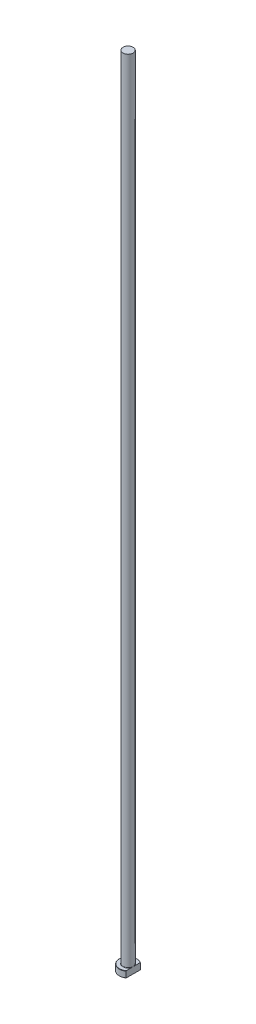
ISO-10303-21;
HEADER;
FILE_DESCRIPTION(('STEP AP214'),'2;1');
FILE_NAME('part.step','',(''),(''),'','','');
FILE_SCHEMA(('AUTOMOTIVE_DESIGN { 1 0 10303 214 1 1 1 1 }'));
ENDSEC;
DATA;
#1=APPLICATION_CONTEXT('core data for automotive mechanical design processes');
#2=APPLICATION_PROTOCOL_DEFINITION('international standard','automotive_design',2000,#1);
#3=PRODUCT_CONTEXT('',#1,'mechanical');
#4=PRODUCT('Part','Part','',(#3));
#5=PRODUCT_RELATED_PRODUCT_CATEGORY('part','',(#4));
#6=PRODUCT_DEFINITION_FORMATION('','',#4);
#7=PRODUCT_DEFINITION_CONTEXT('part definition',#1,'design');
#8=PRODUCT_DEFINITION('design','',#6,#7);
#9=PRODUCT_DEFINITION_SHAPE('','',#8);
#10=(LENGTH_UNIT() NAMED_UNIT(*) SI_UNIT(.MILLI.,.METRE.));
#11=(NAMED_UNIT(*) PLANE_ANGLE_UNIT() SI_UNIT($,.RADIAN.));
#12=(NAMED_UNIT(*) SI_UNIT($,.STERADIAN.) SOLID_ANGLE_UNIT());
#13=UNCERTAINTY_MEASURE_WITH_UNIT(LENGTH_MEASURE(1.E-05),#10,'distance_accuracy_value','');
#14=(GEOMETRIC_REPRESENTATION_CONTEXT(3) GLOBAL_UNCERTAINTY_ASSIGNED_CONTEXT((#13)) GLOBAL_UNIT_ASSIGNED_CONTEXT((#10,
#11,#12)) REPRESENTATION_CONTEXT('',''));
#15=CARTESIAN_POINT('',(0.,0.,0.));
#16=DIRECTION('',(0.,0.,1.));
#17=DIRECTION('',(1.,0.,0.));
#18=AXIS2_PLACEMENT_3D('',#15,#16,#17);
#19=CARTESIAN_POINT('',(0.,0.,0.));
#20=DIRECTION('',(0.,-1.,0.));
#21=DIRECTION('',(0.,0.,-1.));
#22=AXIS2_PLACEMENT_3D('',#19,#20,#21);
#23=PLANE('',#22);
#24=CARTESIAN_POINT('',(0.,0.,0.));
#25=DIRECTION('',(0.,-1.,0.));
#26=DIRECTION('',(0.,0.,-1.));
#27=AXIS2_PLACEMENT_3D('',#24,#25,#26);
#28=CIRCLE('',#27,6.80000000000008);
#29=CARTESIAN_POINT('',(3.99999999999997,0.,5.49909083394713));
#30=VERTEX_POINT('',#29);
#31=CARTESIAN_POINT('',(3.99999999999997,0.,-5.49909083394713));
#32=VERTEX_POINT('',#31);
#33=EDGE_CURVE('E98',#30,#32,#28,.T.);
#34=ORIENTED_EDGE('',*,*,#33,.T.);
#35=DIRECTION('',(0.,0.,1.));
#36=VECTOR('',#35,1.);
#37=CARTESIAN_POINT('',(3.99999999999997,0.,-5.74456264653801));
#38=LINE('',#37,#36);
#39=EDGE_CURVE('E83',#32,#30,#38,.T.);
#40=ORIENTED_EDGE('',*,*,#39,.T.);
#41=EDGE_LOOP('',(#34,#40));
#42=FACE_BOUND('',#41,.T.);
#43=ADVANCED_FACE('F32',(#42),#23,.T.);
#44=CARTESIAN_POINT('',(0.,259.958771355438,0.));
#45=DIRECTION('',(0.,1.,0.));
#46=DIRECTION('',(0.,0.,1.));
#47=AXIS2_PLACEMENT_3D('',#44,#45,#46);
#48=CYLINDRICAL_SURFACE('',#47,6.99999999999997);
#49=CARTESIAN_POINT('',(0.,4.79999999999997,0.));
#50=DIRECTION('',(0.,1.,0.));
#51=DIRECTION('',(0.,0.,1.));
#52=AXIS2_PLACEMENT_3D('',#49,#50,#51);
#53=CIRCLE('',#52,6.99999999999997);
#54=CARTESIAN_POINT('',(3.99999999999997,4.79999999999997,5.74456264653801));
#55=VERTEX_POINT('',#54);
#56=CARTESIAN_POINT('',(3.99999999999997,4.79999999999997,-5.74456264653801));
#57=VERTEX_POINT('',#56);
#58=EDGE_CURVE('E104',#55,#57,#53,.F.);
#59=ORIENTED_EDGE('',*,*,#58,.T.);
#60=DIRECTION('',(0.,-1.,0.));
#61=VECTOR('',#60,1.);
#62=CARTESIAN_POINT('',(3.99999999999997,630.,-5.74456264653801));
#63=LINE('',#62,#61);
#64=CARTESIAN_POINT('',(3.99999999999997,0.199999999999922,-5.74456264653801));
#65=VERTEX_POINT('',#64);
#66=EDGE_CURVE('E183',#57,#65,#63,.T.);
#67=ORIENTED_EDGE('',*,*,#66,.T.);
#68=CARTESIAN_POINT('',(0.,0.199999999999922,0.));
#69=DIRECTION('',(0.,-1.,0.));
#70=DIRECTION('',(0.,0.,-1.));
#71=AXIS2_PLACEMENT_3D('',#68,#69,#70);
#72=CIRCLE('',#71,6.99999999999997);
#73=CARTESIAN_POINT('',(3.99999999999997,0.199999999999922,5.74456264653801));
#74=VERTEX_POINT('',#73);
#75=EDGE_CURVE('E100',#65,#74,#72,.F.);
#76=ORIENTED_EDGE('',*,*,#75,.T.);
#77=DIRECTION('',(0.,-1.,0.));
#78=VECTOR('',#77,1.);
#79=CARTESIAN_POINT('',(3.99999999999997,630.,5.74456264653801));
#80=LINE('',#79,#78);
#81=EDGE_CURVE('E93',#55,#74,#80,.T.);
#82=ORIENTED_EDGE('',*,*,#81,.F.);
#83=EDGE_LOOP('',(#59,#67,#76,#82));
#84=FACE_BOUND('',#83,.T.);
#85=ADVANCED_FACE('F158',(#84),#48,.T.);
#86=CARTESIAN_POINT('',(-6.99999999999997,5.,0.));
#87=DIRECTION('',(0.,1.,0.));
#88=DIRECTION('',(0.,0.,1.));
#89=AXIS2_PLACEMENT_3D('',#86,#87,#88);
#90=PLANE('',#89);
#91=CARTESIAN_POINT('',(0.,5.,0.));
#92=DIRECTION('',(0.,1.,0.));
#93=DIRECTION('',(0.,0.,1.));
#94=AXIS2_PLACEMENT_3D('',#91,#92,#93);
#95=CIRCLE('',#94,6.79999999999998);
#96=CARTESIAN_POINT('',(3.99999999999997,5.,-5.499090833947));
#97=VERTEX_POINT('',#96);
#98=CARTESIAN_POINT('',(3.99999999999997,5.,5.499090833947));
#99=VERTEX_POINT('',#98);
#100=EDGE_CURVE('E178',#97,#99,#95,.T.);
#101=ORIENTED_EDGE('',*,*,#100,.T.);
#102=DIRECTION('',(0.,0.,-1.));
#103=VECTOR('',#102,1.);
#104=CARTESIAN_POINT('',(3.99999999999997,5.,0.));
#105=LINE('',#104,#103);
#106=CARTESIAN_POINT('',(3.99999999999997,4.99999999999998,1.28062484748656));
#107=VERTEX_POINT('',#106);
#108=EDGE_CURVE('E57',#99,#107,#105,.T.);
#109=ORIENTED_EDGE('',*,*,#108,.T.);
#110=CARTESIAN_POINT('',(0.,5.,0.));
#111=DIRECTION('',(0.,1.,0.));
#112=DIRECTION('',(0.,0.,1.));
#113=AXIS2_PLACEMENT_3D('',#110,#111,#112);
#114=CIRCLE('',#113,4.19999999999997);
#115=CARTESIAN_POINT('',(3.99999999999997,4.99999999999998,-1.28062484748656));
#116=VERTEX_POINT('',#115);
#117=EDGE_CURVE('E107',#107,#116,#114,.F.);
#118=ORIENTED_EDGE('',*,*,#117,.T.);
#119=EDGE_CURVE('E136',#116,#97,#105,.T.);
#120=ORIENTED_EDGE('',*,*,#119,.T.);
#121=EDGE_LOOP('',(#101,#109,#118,#120));
#122=FACE_BOUND('',#121,.T.);
#123=ADVANCED_FACE('F147',(#122),#90,.T.);
#124=CARTESIAN_POINT('',(0.,5.,0.));
#125=DIRECTION('',(0.,-1.,0.));
#126=DIRECTION('',(0.,0.,-1.));
#127=AXIS2_PLACEMENT_3D('',#124,#125,#126);
#128=CONICAL_SURFACE('',#127,6.79999999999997,0.785398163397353);
#129=ORIENTED_EDGE('',*,*,#58,.F.);
#130=CARTESIAN_POINT('',(3.99999999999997,-1.45712845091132,12.6392822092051));
#131=CARTESIAN_POINT('',(3.99999999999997,-1.24364466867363,12.4153556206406));
#132=CARTESIAN_POINT('',(3.99999999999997,-1.03042430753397,12.1911774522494));
#133=CARTESIAN_POINT('',(3.99999999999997,-0.604617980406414,11.7422167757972));
#134=CARTESIAN_POINT('',(3.99999999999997,-0.392032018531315,11.5174342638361));
#135=CARTESIAN_POINT('',(3.99999999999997,0.0324624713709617,11.0670952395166));
#136=CARTESIAN_POINT('',(3.99999999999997,0.244370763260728,10.8415385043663));
#137=CARTESIAN_POINT('',(3.99999999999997,0.667290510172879,10.3895875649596));
#138=CARTESIAN_POINT('',(3.99999999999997,0.878301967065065,10.1631933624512));
#139=CARTESIAN_POINT('',(3.99999999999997,1.51385375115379,9.4781012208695));
#140=CARTESIAN_POINT('',(3.99999999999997,1.93676291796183,9.01788214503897));
#141=CARTESIAN_POINT('',(3.99999999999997,2.56612335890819,8.32309905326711));
#142=CARTESIAN_POINT('',(3.99999999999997,2.77505666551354,8.09078457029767));
#143=CARTESIAN_POINT('',(3.99999999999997,3.19080254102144,7.62426940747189));
#144=CARTESIAN_POINT('',(3.99999999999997,3.3976151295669,7.39006874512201));
#145=CARTESIAN_POINT('',(3.99999999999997,3.87870763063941,6.83891844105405));
#146=CARTESIAN_POINT('',(3.99999999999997,4.15190978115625,6.52102188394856));
#147=CARTESIAN_POINT('',(3.99999999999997,4.55642425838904,6.0396090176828));
#148=CARTESIAN_POINT('',(3.99999999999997,4.69041050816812,5.87833992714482));
#149=CARTESIAN_POINT('',(3.99999999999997,4.95616531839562,5.55398469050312));
#150=CARTESIAN_POINT('',(3.99999999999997,5.08793391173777,5.39089857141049));
#151=CARTESIAN_POINT('',(3.99999999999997,5.34841712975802,5.0628880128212));
#152=CARTESIAN_POINT('',(3.99999999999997,5.47713786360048,4.89796843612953));
#153=CARTESIAN_POINT('',(3.99999999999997,5.7310749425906,4.56545535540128));
#154=CARTESIAN_POINT('',(3.99999999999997,5.8562914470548,4.39786197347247));
#155=CARTESIAN_POINT('',(3.99999999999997,6.10211465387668,4.05948444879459));
#156=CARTESIAN_POINT('',(3.99999999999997,6.22272435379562,3.88870249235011));
#157=CARTESIAN_POINT('',(3.99999999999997,6.45796076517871,3.54308312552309));
#158=CARTESIAN_POINT('',(3.99999999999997,6.5725886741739,3.36824653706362));
#159=CARTESIAN_POINT('',(3.99999999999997,6.76866603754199,3.0538139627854));
#160=CARTESIAN_POINT('',(3.99999999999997,6.85173773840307,2.91523359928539));
#161=CARTESIAN_POINT('',(3.99999999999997,7.01174537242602,2.63451965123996));
#162=CARTESIAN_POINT('',(3.99999999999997,7.08868042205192,2.49238555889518));
#163=CARTESIAN_POINT('',(3.99999999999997,7.23459437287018,2.20416961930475));
#164=CARTESIAN_POINT('',(3.99999999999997,7.30357836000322,2.05809037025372));
#165=CARTESIAN_POINT('',(3.99999999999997,7.43135520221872,1.76151732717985));
#166=CARTESIAN_POINT('',(3.99999999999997,7.49015114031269,1.61102488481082));
#167=CARTESIAN_POINT('',(3.99999999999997,7.58249315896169,1.3414209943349));
#168=CARTESIAN_POINT('',(3.99999999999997,7.61872660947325,1.22323501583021));
#169=CARTESIAN_POINT('',(3.99999999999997,7.68223354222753,0.984492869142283));
#170=CARTESIAN_POINT('',(3.99999999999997,7.7095104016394,0.863937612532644));
#171=CARTESIAN_POINT('',(3.99999999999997,7.75377914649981,0.621342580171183));
#172=CARTESIAN_POINT('',(3.99999999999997,7.77080509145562,0.499309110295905));
#173=CARTESIAN_POINT('',(3.99999999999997,7.79378778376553,0.254194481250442));
#174=CARTESIAN_POINT('',(3.99999999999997,7.79974523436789,0.131113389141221));
#175=CARTESIAN_POINT('',(3.99999999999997,7.80023957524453,-0.115517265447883));
#176=CARTESIAN_POINT('',(3.99999999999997,7.79473514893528,-0.23906691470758));
#177=CARTESIAN_POINT('',(3.99999999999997,7.77255119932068,-0.485148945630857));
#178=CARTESIAN_POINT('',(3.99999999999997,7.75587091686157,-0.60768125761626));
#179=CARTESIAN_POINT('',(3.99999999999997,7.71218353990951,-0.851269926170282));
#180=CARTESIAN_POINT('',(3.99999999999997,7.6851436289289,-0.972320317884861));
#181=CARTESIAN_POINT('',(3.99999999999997,7.62201202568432,-1.21200276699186));
#182=CARTESIAN_POINT('',(3.99999999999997,7.58591962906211,-1.33063463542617));
#183=CARTESIAN_POINT('',(3.99999999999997,7.45980070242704,-1.7012243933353));
#184=CARTESIAN_POINT('',(3.99999999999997,7.35572950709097,-1.94843335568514));
#185=CARTESIAN_POINT('',(3.99999999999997,7.18186715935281,-2.31048534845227));
#186=CARTESIAN_POINT('',(3.99999999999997,7.1208768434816,-2.42983561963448));
#187=CARTESIAN_POINT('',(3.99999999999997,6.99403531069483,-2.66593629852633));
#188=CARTESIAN_POINT('',(3.99999999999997,6.9281846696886,-2.78268701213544));
#189=CARTESIAN_POINT('',(3.99999999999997,6.79157875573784,-3.01550895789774));
#190=CARTESIAN_POINT('',(3.99999999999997,6.7207668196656,-3.13154660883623));
#191=CARTESIAN_POINT('',(3.99999999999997,6.57583116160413,-3.36153379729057));
#192=CARTESIAN_POINT('',(3.99999999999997,6.5017073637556,-3.47548328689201));
#193=CARTESIAN_POINT('',(3.99999999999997,6.35080982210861,-3.70145107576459));
#194=CARTESIAN_POINT('',(3.99999999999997,6.27403866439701,-3.81347110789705));
#195=CARTESIAN_POINT('',(3.99999999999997,6.1182412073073,-4.03592316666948));
#196=CARTESIAN_POINT('',(3.99999999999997,6.0392149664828,-4.14635523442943));
#197=CARTESIAN_POINT('',(3.99999999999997,5.81506547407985,-4.45397159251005));
#198=CARTESIAN_POINT('',(3.99999999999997,5.66782256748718,-4.64961120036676));
#199=CARTESIAN_POINT('',(3.99999999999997,5.36880597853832,-5.0374060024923));
#200=CARTESIAN_POINT('',(3.99999999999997,5.21703183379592,-5.22956083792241));
#201=CARTESIAN_POINT('',(3.99999999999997,4.90999105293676,-5.61115465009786));
#202=CARTESIAN_POINT('',(3.99999999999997,4.75472331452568,-5.80059273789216));
#203=CARTESIAN_POINT('',(3.99999999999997,4.44150758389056,-6.17724364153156));
#204=CARTESIAN_POINT('',(3.99999999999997,4.28355951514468,-6.36445639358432));
#205=CARTESIAN_POINT('',(3.99999999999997,3.96525805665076,-6.73740614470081));
#206=CARTESIAN_POINT('',(3.99999999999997,3.80490084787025,-6.9231398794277));
#207=CARTESIAN_POINT('',(3.99999999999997,3.48247055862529,-7.29311320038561));
#208=CARTESIAN_POINT('',(3.99999999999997,3.32039746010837,-7.4773527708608));
#209=CARTESIAN_POINT('',(3.99999999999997,2.83216188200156,-8.02814826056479));
#210=CARTESIAN_POINT('',(3.99999999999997,2.50391696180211,-8.39285790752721));
#211=CARTESIAN_POINT('',(3.99999999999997,1.87512078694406,-9.08414492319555));
#212=CARTESIAN_POINT('',(3.99999999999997,1.57491666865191,-9.41103929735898));
#213=CARTESIAN_POINT('',(3.99999999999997,0.972153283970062,-10.0626830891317));
#214=CARTESIAN_POINT('',(3.99999999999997,0.669593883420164,-10.3874323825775));
#215=CARTESIAN_POINT('',(3.99999999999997,0.0637759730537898,-11.0341169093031));
#216=CARTESIAN_POINT('',(3.99999999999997,-0.239476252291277,-11.3560580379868));
#217=CARTESIAN_POINT('',(3.99999999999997,-0.847356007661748,-11.9985921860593));
#218=CARTESIAN_POINT('',(3.99999999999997,-1.15198342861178,-12.3191853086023));
#219=CARTESIAN_POINT('',(3.99999999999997,-1.45712845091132,-12.6392822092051));
#220=B_SPLINE_CURVE_WITH_KNOTS('',3,(#130,#131,#132,#133,#134,#135,#136,#137,#138,#139,#140,
#141,#142,#143,#144,#145,#146,#147,#148,#149,#150,#151,#152,#153,#154,#155,#156,#157,#158,#159,
#160,#161,#162,#163,#164,#165,#166,#167,#168,#169,#170,#171,#172,#173,#174,#175,#176,#177,#178,
#179,#180,#181,#182,#183,#184,#185,#186,#187,#188,#189,#190,#191,#192,#193,#194,#195,#196,#197,
#198,#199,#200,#201,#202,#203,#204,#205,#206,#207,#208,#209,#210,#211,#212,#213,#214,#215,#216,
#217,#218,#219),.UNSPECIFIED.,.F.,.F.,(4,2,2,2,2,2,2,2,2,2,2,2,2,2,2,2,2,2,2,2,2,2,2,2,2,2,2,2,
2,2,2,2,2,2,2,2,2,2,2,2,2,2,2,2,4),(0.,0.928152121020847,1.85631024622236,2.78476262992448,
3.71321307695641,5.58823033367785,6.5255607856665,7.46288254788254,8.72028576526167,
9.34927045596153,9.97824580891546,10.6058302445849,11.2333861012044,11.860526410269,
12.4875406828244,12.972136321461,13.4568016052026,13.9411551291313,14.4253618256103,
14.7959147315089,15.166327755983,15.5355031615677,15.9046551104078,16.2751400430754,
16.6456501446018,17.0173437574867,17.3890663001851,18.1913996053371,18.5934522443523,
18.9954573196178,19.4032100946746,19.8109722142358,20.218346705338,20.6257106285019,
21.3601838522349,22.0947322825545,22.8295158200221,23.5643203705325,24.3004480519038,
25.0365834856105,26.5085499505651,27.8400191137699,29.1715646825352,30.4983881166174,
31.825108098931),.UNSPECIFIED.);
#221=EDGE_CURVE('E135',#55,#99,#220,.T.);
#222=ORIENTED_EDGE('',*,*,#221,.T.);
#223=ORIENTED_EDGE('',*,*,#100,.F.);
#224=EDGE_CURVE('E127',#97,#57,#220,.T.);
#225=ORIENTED_EDGE('',*,*,#224,.T.);
#226=EDGE_LOOP('',(#129,#222,#223,#225));
#227=FACE_BOUND('',#226,.T.);
#228=ADVANCED_FACE('F143',(#227),#128,.T.);
#229=CARTESIAN_POINT('',(0.,0.199999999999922,0.));
#230=DIRECTION('',(0.,1.,0.));
#231=DIRECTION('',(0.,0.,1.));
#232=AXIS2_PLACEMENT_3D('',#229,#230,#231);
#233=CONICAL_SURFACE('',#232,6.99999999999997,0.785398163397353);
#234=ORIENTED_EDGE('',*,*,#75,.F.);
#235=CARTESIAN_POINT('',(3.99999999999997,6.45712845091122,-12.6392822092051));
#236=CARTESIAN_POINT('',(3.99999999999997,6.24364466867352,-12.4153556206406));
#237=CARTESIAN_POINT('',(3.99999999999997,6.03042430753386,-12.1911774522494));
#238=CARTESIAN_POINT('',(3.99999999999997,5.60461798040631,-11.7422167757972));
#239=CARTESIAN_POINT('',(3.99999999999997,5.39203201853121,-11.5174342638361));
#240=CARTESIAN_POINT('',(3.99999999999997,4.96753752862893,-11.0670952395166));
#241=CARTESIAN_POINT('',(3.99999999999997,4.75562923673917,-10.8415385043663));
#242=CARTESIAN_POINT('',(3.99999999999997,4.33270948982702,-10.3895875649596));
#243=CARTESIAN_POINT('',(3.99999999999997,4.12169803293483,-10.1631933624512));
#244=CARTESIAN_POINT('',(3.99999999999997,3.48614624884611,-9.4781012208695));
#245=CARTESIAN_POINT('',(3.99999999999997,3.06323708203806,-9.01788214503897));
#246=CARTESIAN_POINT('',(3.99999999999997,2.43387664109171,-8.32309905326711));
#247=CARTESIAN_POINT('',(3.99999999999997,2.22494333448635,-8.09078457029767));
#248=CARTESIAN_POINT('',(3.99999999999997,1.80919745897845,-7.62426940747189));
#249=CARTESIAN_POINT('',(3.99999999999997,1.602384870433,-7.39006874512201));
#250=CARTESIAN_POINT('',(3.99999999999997,1.12129236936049,-6.83891844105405));
#251=CARTESIAN_POINT('',(3.99999999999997,0.848090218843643,-6.52102188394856));
#252=CARTESIAN_POINT('',(3.99999999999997,0.443575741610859,-6.0396090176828));
#253=CARTESIAN_POINT('',(3.99999999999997,0.309589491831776,-5.87833992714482));
#254=CARTESIAN_POINT('',(3.99999999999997,0.043834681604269,-5.55398469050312));
#255=CARTESIAN_POINT('',(3.99999999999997,-0.0879339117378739,-5.3908985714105));
#256=CARTESIAN_POINT('',(3.99999999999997,-0.348417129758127,-5.0628880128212));
#257=CARTESIAN_POINT('',(3.99999999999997,-0.477137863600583,-4.89796843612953));
#258=CARTESIAN_POINT('',(3.99999999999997,-0.731074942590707,-4.56545535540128));
#259=CARTESIAN_POINT('',(3.99999999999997,-0.85629144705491,-4.39786197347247));
#260=CARTESIAN_POINT('',(3.99999999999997,-1.10211465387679,-4.05948444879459));
#261=CARTESIAN_POINT('',(3.99999999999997,-1.22272435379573,-3.88870249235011));
#262=CARTESIAN_POINT('',(3.99999999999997,-1.45796076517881,-3.54308312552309));
#263=CARTESIAN_POINT('',(3.99999999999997,-1.57258867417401,-3.36824653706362));
#264=CARTESIAN_POINT('',(3.99999999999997,-1.7686660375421,-3.0538139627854));
#265=CARTESIAN_POINT('',(3.99999999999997,-1.85173773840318,-2.91523359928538));
#266=CARTESIAN_POINT('',(3.99999999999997,-2.01174537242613,-2.63451965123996));
#267=CARTESIAN_POINT('',(3.99999999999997,-2.08868042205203,-2.49238555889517));
#268=CARTESIAN_POINT('',(3.99999999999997,-2.23459437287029,-2.20416961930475));
#269=CARTESIAN_POINT('',(3.99999999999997,-2.30357836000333,-2.05809037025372));
#270=CARTESIAN_POINT('',(3.99999999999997,-2.43135520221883,-1.76151732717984));
#271=CARTESIAN_POINT('',(3.99999999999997,-2.4901511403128,-1.61102488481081));
#272=CARTESIAN_POINT('',(3.99999999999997,-2.5824931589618,-1.34142099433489));
#273=CARTESIAN_POINT('',(3.99999999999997,-2.61872660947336,-1.2232350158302));
#274=CARTESIAN_POINT('',(3.99999999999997,-2.68223354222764,-0.984492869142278));
#275=CARTESIAN_POINT('',(3.99999999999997,-2.70951040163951,-0.863937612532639));
#276=CARTESIAN_POINT('',(3.99999999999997,-2.75377914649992,-0.621342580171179));
#277=CARTESIAN_POINT('',(3.99999999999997,-2.77080509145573,-0.4993091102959));
#278=CARTESIAN_POINT('',(3.99999999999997,-2.79378778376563,-0.254194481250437));
#279=CARTESIAN_POINT('',(3.99999999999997,-2.799745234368,-0.131113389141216));
#280=CARTESIAN_POINT('',(3.99999999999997,-2.80023957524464,0.115517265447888));
#281=CARTESIAN_POINT('',(3.99999999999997,-2.79473514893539,0.239066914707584));
#282=CARTESIAN_POINT('',(3.99999999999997,-2.77255119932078,0.48514894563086));
#283=CARTESIAN_POINT('',(3.99999999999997,-2.75587091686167,0.607681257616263));
#284=CARTESIAN_POINT('',(3.99999999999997,-2.71218353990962,0.851269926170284));
#285=CARTESIAN_POINT('',(3.99999999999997,-2.68514362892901,0.972320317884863));
#286=CARTESIAN_POINT('',(3.99999999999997,-2.62201202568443,1.21200276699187));
#287=CARTESIAN_POINT('',(3.99999999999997,-2.58591962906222,1.33063463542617));
#288=CARTESIAN_POINT('',(3.99999999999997,-2.45980070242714,1.70122439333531));
#289=CARTESIAN_POINT('',(3.99999999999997,-2.35572950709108,1.94843335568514));
#290=CARTESIAN_POINT('',(3.99999999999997,-2.18186715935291,2.31048534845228));
#291=CARTESIAN_POINT('',(3.99999999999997,-2.1208768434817,2.42983561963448));
#292=CARTESIAN_POINT('',(3.99999999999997,-1.99403531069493,2.66593629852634));
#293=CARTESIAN_POINT('',(3.99999999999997,-1.9281846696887,2.78268701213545));
#294=CARTESIAN_POINT('',(3.99999999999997,-1.79157875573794,3.01550895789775));
#295=CARTESIAN_POINT('',(3.99999999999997,-1.7207668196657,3.13154660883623));
#296=CARTESIAN_POINT('',(3.99999999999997,-1.57583116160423,3.36153379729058));
#297=CARTESIAN_POINT('',(3.99999999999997,-1.5017073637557,3.47548328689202));
#298=CARTESIAN_POINT('',(3.99999999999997,-1.35080982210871,3.7014510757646));
#299=CARTESIAN_POINT('',(3.99999999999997,-1.27403866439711,3.81347110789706));
#300=CARTESIAN_POINT('',(3.99999999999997,-1.1182412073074,4.03592316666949));
#301=CARTESIAN_POINT('',(3.99999999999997,-1.0392149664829,4.14635523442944));
#302=CARTESIAN_POINT('',(3.99999999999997,-0.815065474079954,4.45397159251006));
#303=CARTESIAN_POINT('',(3.99999999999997,-0.667822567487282,4.64961120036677));
#304=CARTESIAN_POINT('',(3.99999999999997,-0.368805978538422,5.03740600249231));
#305=CARTESIAN_POINT('',(3.99999999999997,-0.217031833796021,5.22956083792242));
#306=CARTESIAN_POINT('',(3.99999999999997,0.0900089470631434,5.61115465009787));
#307=CARTESIAN_POINT('',(3.99999999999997,0.24527668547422,5.80059273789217));
#308=CARTESIAN_POINT('',(3.99999999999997,0.558492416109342,6.17724364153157));
#309=CARTESIAN_POINT('',(3.99999999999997,0.716440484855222,6.36445639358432));
#310=CARTESIAN_POINT('',(3.99999999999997,1.03474194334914,6.73740614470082));
#311=CARTESIAN_POINT('',(3.99999999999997,1.19509915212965,6.92313987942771));
#312=CARTESIAN_POINT('',(3.99999999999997,1.51752944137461,7.29311320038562));
#313=CARTESIAN_POINT('',(3.99999999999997,1.67960253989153,7.47735277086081));
#314=CARTESIAN_POINT('',(3.99999999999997,2.16783811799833,8.0281482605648));
#315=CARTESIAN_POINT('',(3.99999999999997,2.49608303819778,8.39285790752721));
#316=CARTESIAN_POINT('',(3.99999999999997,3.12487921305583,9.08414492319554));
#317=CARTESIAN_POINT('',(3.99999999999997,3.42508333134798,9.41103929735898));
#318=CARTESIAN_POINT('',(3.99999999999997,4.02784671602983,10.0626830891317));
#319=CARTESIAN_POINT('',(3.99999999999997,4.33040611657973,10.3874323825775));
#320=CARTESIAN_POINT('',(3.99999999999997,4.9362240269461,11.0341169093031));
#321=CARTESIAN_POINT('',(3.99999999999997,5.23947625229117,11.3560580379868));
#322=CARTESIAN_POINT('',(3.99999999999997,5.84735600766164,11.9985921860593));
#323=CARTESIAN_POINT('',(3.99999999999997,6.15198342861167,12.3191853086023));
#324=CARTESIAN_POINT('',(3.99999999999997,6.45712845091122,12.6392822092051));
#325=B_SPLINE_CURVE_WITH_KNOTS('',3,(#235,#236,#237,#238,#239,#240,#241,#242,#243,#244,#245,
#246,#247,#248,#249,#250,#251,#252,#253,#254,#255,#256,#257,#258,#259,#260,#261,#262,#263,#264,
#265,#266,#267,#268,#269,#270,#271,#272,#273,#274,#275,#276,#277,#278,#279,#280,#281,#282,#283,
#284,#285,#286,#287,#288,#289,#290,#291,#292,#293,#294,#295,#296,#297,#298,#299,#300,#301,#302,
#303,#304,#305,#306,#307,#308,#309,#310,#311,#312,#313,#314,#315,#316,#317,#318,#319,#320,#321,
#322,#323,#324),.UNSPECIFIED.,.F.,.F.,(4,2,2,2,2,2,2,2,2,2,2,2,2,2,2,2,2,2,2,2,2,2,2,2,2,2,2,2,
2,2,2,2,2,2,2,2,2,2,2,2,2,2,2,2,4),(0.,0.928152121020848,1.85631024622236,2.78476262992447,
3.71321307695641,5.58823033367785,6.5255607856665,7.46288254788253,8.72028576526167,
9.34927045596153,9.97824580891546,10.6058302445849,11.2333861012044,11.860526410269,
12.4875406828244,12.972136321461,13.4568016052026,13.9411551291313,14.4253618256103,
14.7959147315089,15.1663277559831,15.5355031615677,15.9046551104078,16.2751400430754,
16.6456501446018,17.0173437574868,17.3890663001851,18.1913996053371,18.5934522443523,
18.9954573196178,19.4032100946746,19.8109722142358,20.218346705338,20.6257106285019,
21.3601838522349,22.0947322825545,22.8295158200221,23.5643203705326,24.3004480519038,
25.0365834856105,26.5085499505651,27.8400191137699,29.1715646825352,30.4983881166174,
31.825108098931),.UNSPECIFIED.);
#326=EDGE_CURVE('E86',#65,#32,#325,.T.);
#327=ORIENTED_EDGE('',*,*,#326,.T.);
#328=ORIENTED_EDGE('',*,*,#33,.F.);
#329=EDGE_CURVE('E89',#30,#74,#325,.T.);
#330=ORIENTED_EDGE('',*,*,#329,.T.);
#331=EDGE_LOOP('',(#234,#327,#328,#330));
#332=FACE_BOUND('',#331,.T.);
#333=ADVANCED_FACE('F97',(#332),#233,.T.);
#334=CARTESIAN_POINT('',(0.,5.19999999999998,0.));
#335=DIRECTION('',(0.,1.,0.));
#336=DIRECTION('',(0.,0.,1.));
#337=AXIS2_PLACEMENT_3D('',#334,#335,#336);
#338=TOROIDAL_SURFACE('',#337,4.19999999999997,0.2);
#339=CARTESIAN_POINT('',(3.99999999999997,5.19999999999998,0.));
#340=CARTESIAN_POINT('',(3.99999999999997,5.20000051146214,6.55036346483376E-12));
#341=CARTESIAN_POINT('',(3.99999999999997,5.20000102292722,-2.33849506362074E-07));
#342=CARTESIAN_POINT('',(3.99999999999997,5.20000197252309,-8.59106878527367E-07));
#343=CARTESIAN_POINT('',(3.99999999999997,5.20000239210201,-1.26721104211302E-06));
#344=CARTESIAN_POINT('',(3.99999999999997,5.2000032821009,-2.25074272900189E-06));
#345=CARTESIAN_POINT('',(3.99999999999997,5.20000373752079,-2.84212509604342E-06));
#346=CARTESIAN_POINT('',(3.99999999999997,5.20000453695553,-4.0532804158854E-06));
#347=CARTESIAN_POINT('',(3.99999999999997,5.20000488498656,-4.67066373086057E-06));
#348=CARTESIAN_POINT('',(3.99999999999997,5.20000621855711,-7.11716595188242E-06));
#349=CARTESIAN_POINT('',(3.99999999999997,5.20000713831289,-8.9855846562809E-06));
#350=CARTESIAN_POINT('',(3.99999999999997,5.20000861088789,-1.26418241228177E-05));
#351=CARTESIAN_POINT('',(3.99999999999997,5.20000919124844,-1.44189478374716E-05));
#352=CARTESIAN_POINT('',(3.99999999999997,5.20001169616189,-2.20915834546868E-05));
#353=CARTESIAN_POINT('',(3.99999999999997,5.20001361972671,-2.79894745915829E-05));
#354=CARTESIAN_POINT('',(3.99999999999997,5.20001638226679,-3.90228530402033E-05));
#355=CARTESIAN_POINT('',(3.99999999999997,5.20001734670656,-4.41264575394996E-05));
#356=CARTESIAN_POINT('',(3.99999999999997,5.20002447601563,-8.24800894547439E-05));
#357=CARTESIAN_POINT('',(3.99999999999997,5.20003000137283,-0.000115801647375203));
#358=CARTESIAN_POINT('',(3.99999999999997,5.20005417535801,-0.000248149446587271));
#359=CARTESIAN_POINT('',(3.99999999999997,5.20007711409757,-0.00034639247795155));
#360=CARTESIAN_POINT('',(3.99999999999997,5.20016695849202,-0.000737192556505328));
#361=CARTESIAN_POINT('',(3.99999999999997,5.2002311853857,-0.00103015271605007));
#362=CARTESIAN_POINT('',(3.99999999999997,5.20048943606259,-0.00220000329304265));
#363=CARTESIAN_POINT('',(3.99999999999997,5.20068689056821,-0.00307635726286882));
#364=CARTESIAN_POINT('',(3.99999999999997,5.2015124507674,-0.00674945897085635));
#365=CARTESIAN_POINT('',(3.99999999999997,5.20213623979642,-0.00954688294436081));
#366=CARTESIAN_POINT('',(3.99999999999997,5.21069858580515,-0.0479346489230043));
#367=CARTESIAN_POINT('',(3.99999999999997,5.21866411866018,-0.083521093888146));
#368=CARTESIAN_POINT('',(3.99999999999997,5.23536251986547,-0.158673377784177));
#369=CARTESIAN_POINT('',(3.99999999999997,5.24408230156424,-0.198242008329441));
#370=CARTESIAN_POINT('',(3.99999999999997,5.25875222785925,-0.265746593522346));
#371=CARTESIAN_POINT('',(3.99999999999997,5.264760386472,-0.293669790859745));
#372=CARTESIAN_POINT('',(3.99999999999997,5.27645424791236,-0.348796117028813));
#373=CARTESIAN_POINT('',(3.99999999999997,5.2821442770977,-0.375998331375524));
#374=CARTESIAN_POINT('',(3.99999999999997,5.30043795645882,-0.465036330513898));
#375=CARTESIAN_POINT('',(3.99999999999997,5.31263876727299,-0.526956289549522));
#376=CARTESIAN_POINT('',(3.99999999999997,5.33561275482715,-0.65168218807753));
#377=CARTESIAN_POINT('',(3.99999999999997,5.34637105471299,-0.714490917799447));
#378=CARTESIAN_POINT('',(3.99999999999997,5.36658245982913,-0.846543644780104));
#379=CARTESIAN_POINT('',(3.99999999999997,5.37580902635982,-0.915823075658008));
#380=CARTESIAN_POINT('',(3.99999999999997,5.39039845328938,-1.05460878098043));
#381=CARTESIAN_POINT('',(3.99999999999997,5.39577328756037,-1.12411367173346));
#382=CARTESIAN_POINT('',(3.99999999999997,5.39959291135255,-1.22750409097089));
#383=CARTESIAN_POINT('',(3.99999999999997,5.40018074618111,-1.26130913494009));
#384=CARTESIAN_POINT('',(3.99999999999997,5.39972074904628,-1.32890426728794));
#385=CARTESIAN_POINT('',(3.99999999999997,5.39867346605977,-1.36269435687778));
#386=CARTESIAN_POINT('',(3.99999999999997,5.39455571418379,-1.42954089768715));
#387=CARTESIAN_POINT('',(3.99999999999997,5.39152235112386,-1.46259952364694));
#388=CARTESIAN_POINT('',(3.99999999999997,5.38286512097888,-1.52835908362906));
#389=CARTESIAN_POINT('',(3.99999999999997,5.37724516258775,-1.56106048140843));
#390=CARTESIAN_POINT('',(3.99999999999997,5.36402263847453,-1.61846409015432));
#391=CARTESIAN_POINT('',(3.99999999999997,5.35713757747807,-1.64332989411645));
#392=CARTESIAN_POINT('',(3.99999999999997,5.34027199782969,-1.69212725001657));
#393=CARTESIAN_POINT('',(3.99999999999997,5.33028876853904,-1.7160579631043));
#394=CARTESIAN_POINT('',(3.99999999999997,5.31168601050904,-1.75008824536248));
#395=CARTESIAN_POINT('',(3.99999999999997,5.30485398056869,-1.76115159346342));
#396=CARTESIAN_POINT('',(3.99999999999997,5.28960114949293,-1.78210611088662));
#397=CARTESIAN_POINT('',(3.99999999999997,5.28118962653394,-1.79200360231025));
#398=CARTESIAN_POINT('',(3.99999999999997,5.26737388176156,-1.80493475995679));
#399=CARTESIAN_POINT('',(3.99999999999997,5.26276322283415,-1.80881084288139));
#400=CARTESIAN_POINT('',(3.99999999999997,5.25306023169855,-1.81592390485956));
#401=CARTESIAN_POINT('',(3.99999999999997,5.24796771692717,-1.81916064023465));
#402=CARTESIAN_POINT('',(3.99999999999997,5.23724406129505,-1.82480514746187));
#403=CARTESIAN_POINT('',(3.99999999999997,5.23160666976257,-1.82720134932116));
#404=CARTESIAN_POINT('',(3.99999999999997,5.219971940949,-1.83083611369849));
#405=CARTESIAN_POINT('',(3.99999999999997,5.21397550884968,-1.83207746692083));
#406=CARTESIAN_POINT('',(3.99999999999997,5.20263132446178,-1.83315692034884));
#407=CARTESIAN_POINT('',(3.99999999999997,5.19729868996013,-1.8331541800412));
#408=CARTESIAN_POINT('',(3.99999999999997,5.18672944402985,-1.83214057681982));
#409=CARTESIAN_POINT('',(3.99999999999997,5.18149289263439,-1.83112910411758));
#410=CARTESIAN_POINT('',(3.99999999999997,5.17078487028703,-1.82806907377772));
#411=CARTESIAN_POINT('',(3.99999999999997,5.16533999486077,-1.82592931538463));
#412=CARTESIAN_POINT('',(3.99999999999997,5.1548729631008,-1.82079411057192));
#413=CARTESIAN_POINT('',(3.99999999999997,5.14985146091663,-1.81779737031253));
#414=CARTESIAN_POINT('',(3.99999999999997,5.13773920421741,-1.80942140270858));
#415=CARTESIAN_POINT('',(3.99999999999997,5.13094534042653,-1.80361715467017));
#416=CARTESIAN_POINT('',(3.99999999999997,5.11830005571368,-1.79106454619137));
#417=CARTESIAN_POINT('',(3.99999999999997,5.11245134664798,-1.78431356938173));
#418=CARTESIAN_POINT('',(3.99999999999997,5.09656788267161,-1.76377799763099));
#419=CARTESIAN_POINT('',(3.99999999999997,5.08757958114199,-1.74919341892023));
#420=CARTESIAN_POINT('',(3.99999999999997,5.07165230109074,-1.71899459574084));
#421=CARTESIAN_POINT('',(3.99999999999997,5.064716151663,-1.70337896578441));
#422=CARTESIAN_POINT('',(3.99999999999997,5.04964646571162,-1.66459665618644));
#423=CARTESIAN_POINT('',(3.99999999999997,5.04232016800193,-1.64111968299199));
#424=CARTESIAN_POINT('',(3.99999999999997,5.02986383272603,-1.59357415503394));
#425=CARTESIAN_POINT('',(3.99999999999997,5.02473853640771,-1.56950444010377));
#426=CARTESIAN_POINT('',(3.99999999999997,5.0161032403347,-1.52067485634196));
#427=CARTESIAN_POINT('',(3.99999999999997,5.01262117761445,-1.49591014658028));
#428=CARTESIAN_POINT('',(3.99999999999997,5.00704256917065,-1.44626562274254));
#429=CARTESIAN_POINT('',(3.99999999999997,5.00494421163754,-1.42138600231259));
#430=CARTESIAN_POINT('',(3.99999999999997,5.00075077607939,-1.35341124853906));
#431=CARTESIAN_POINT('',(3.99999999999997,4.99977133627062,-1.31024782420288));
#432=CARTESIAN_POINT('',(3.99999999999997,5.00031303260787,-1.22392963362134));
#433=CARTESIAN_POINT('',(3.99999999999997,5.00183577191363,-1.18077489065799));
#434=CARTESIAN_POINT('',(3.99999999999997,5.00931890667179,-1.05109835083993));
#435=CARTESIAN_POINT('',(3.99999999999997,5.01820648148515,-0.964749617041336));
#436=CARTESIAN_POINT('',(3.99999999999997,5.03989342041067,-0.800200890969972));
#437=CARTESIAN_POINT('',(3.99999999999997,5.05228816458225,-0.721941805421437));
#438=CARTESIAN_POINT('',(3.99999999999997,5.07962880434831,-0.566748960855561));
#439=CARTESIAN_POINT('',(3.99999999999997,5.09454562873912,-0.4898100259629));
#440=CARTESIAN_POINT('',(3.99999999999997,5.115946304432,-0.385191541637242));
#441=CARTESIAN_POINT('',(3.99999999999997,5.12174621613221,-0.357366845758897));
#442=CARTESIAN_POINT('',(3.99999999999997,5.13367824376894,-0.300962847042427));
#443=CARTESIAN_POINT('',(3.99999999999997,5.13981511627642,-0.272384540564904));
#444=CARTESIAN_POINT('',(3.99999999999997,5.15483459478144,-0.203169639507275));
#445=CARTESIAN_POINT('',(3.99999999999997,5.16378036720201,-0.1625469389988));
#446=CARTESIAN_POINT('',(3.99999999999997,5.18091599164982,-0.0854009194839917));
#447=CARTESIAN_POINT('',(3.99999999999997,5.18909179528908,-0.0488746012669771));
#448=CARTESIAN_POINT('',(3.99999999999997,5.19786384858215,-0.00954647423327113));
#449=CARTESIAN_POINT('',(3.99999999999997,5.19848773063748,-0.0067486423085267));
#450=CARTESIAN_POINT('',(3.99999999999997,5.19931331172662,-0.00307545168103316));
#451=CARTESIAN_POINT('',(3.99999999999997,5.19951069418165,-0.00219941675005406));
#452=CARTESIAN_POINT('',(3.99999999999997,5.19976885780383,-0.00102996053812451));
#453=CARTESIAN_POINT('',(3.99999999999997,5.199833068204,-0.000737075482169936));
#454=CARTESIAN_POINT('',(3.99999999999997,5.19992289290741,-0.00034636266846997));
#455=CARTESIAN_POINT('',(3.99999999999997,5.19994582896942,-0.000248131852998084));
#456=CARTESIAN_POINT('',(3.99999999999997,5.19997000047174,-0.000115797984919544));
#457=CARTESIAN_POINT('',(3.99999999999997,5.19997552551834,-8.24780552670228E-05));
#458=CARTESIAN_POINT('',(3.99999999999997,5.19998265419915,-4.4126093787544E-05));
#459=CARTESIAN_POINT('',(3.99999999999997,5.19998361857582,-3.90225725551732E-05));
#460=CARTESIAN_POINT('',(3.99999999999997,5.19998638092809,-2.79893703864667E-05));
#461=CARTESIAN_POINT('',(3.99999999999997,5.19998830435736,-2.20915678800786E-05));
#462=CARTESIAN_POINT('',(3.99999999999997,5.19999080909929,-1.44190255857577E-05));
#463=CARTESIAN_POINT('',(3.99999999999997,5.19999138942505,-1.26419078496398E-05));
#464=CARTESIAN_POINT('',(3.99999999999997,5.19999286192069,-8.98567517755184E-06));
#465=CARTESIAN_POINT('',(3.99999999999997,5.1999937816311,-7.1172564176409E-06));
#466=CARTESIAN_POINT('',(3.99999999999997,5.19999511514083,-4.67074826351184E-06));
#467=CARTESIAN_POINT('',(3.99999999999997,5.19999546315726,-4.05336147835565E-06));
#468=CARTESIAN_POINT('',(3.99999999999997,5.19999626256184,-2.84219658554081E-06));
#469=CARTESIAN_POINT('',(3.99999999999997,5.19999671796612,-2.25080798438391E-06));
#470=CARTESIAN_POINT('',(3.99999999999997,5.19999760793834,-1.26726200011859E-06));
#471=CARTESIAN_POINT('',(3.99999999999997,5.19999802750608,-8.59150369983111E-07));
#472=CARTESIAN_POINT('',(3.99999999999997,5.19999897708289,-2.33873741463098E-07));
#473=CARTESIAN_POINT('',(3.99999999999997,5.19999948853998,-6.55033592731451E-12));
#474=CARTESIAN_POINT('',(3.99999999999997,5.19999999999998,0.));
#475=B_SPLINE_CURVE_WITH_KNOTS('',3,(#339,#340,#341,#342,#343,#344,#345,#346,#347,#348,#349,
#350,#351,#352,#353,#354,#355,#356,#357,#358,#359,#360,#361,#362,#363,#364,#365,#366,#367,#368,
#369,#370,#371,#372,#373,#374,#375,#376,#377,#378,#379,#380,#381,#382,#383,#384,#385,#386,#387,
#388,#389,#390,#391,#392,#393,#394,#395,#396,#397,#398,#399,#400,#401,#402,#403,#404,#405,#406,
#407,#408,#409,#410,#411,#412,#413,#414,#415,#416,#417,#418,#419,#420,#421,#422,#423,#424,#425,
#426,#427,#428,#429,#430,#431,#432,#433,#434,#435,#436,#437,#438,#439,#440,#441,#442,#443,#444,
#445,#446,#447,#448,#449,#450,#451,#452,#453,#454,#455,#456,#457,#458,#459,#460,#461,#462,#463,
#464,#465,#466,#467,#468,#469,#470,#471,#472,#473,#474),.UNSPECIFIED.,.T.,.F.,(4,2,2,2,2,2,2,2,
2,2,2,2,2,2,2,2,2,2,2,2,2,2,2,2,2,2,2,2,2,2,2,2,2,2,2,2,2,2,2,2,2,2,2,2,2,2,2,2,2,2,2,2,2,2,2,2,
2,2,2,2,2,2,2,2,2,2,2,4),(0.,1.56012585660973E-06,3.32588854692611E-06,5.54921869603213E-06,
7.67484576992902E-06,1.39023138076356E-05,1.95054937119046E-05,3.80905024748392E-05,
5.36549282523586E-05,0.000155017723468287,0.000457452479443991,0.00135744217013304,
0.00405212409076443,0.0126508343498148,0.122049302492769,0.243603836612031,0.329290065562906,
0.412662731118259,0.601981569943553,0.79312323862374,1.00273287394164,1.21168803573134,
1.31308928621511,1.4144564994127,1.51398193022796,1.6133574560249,1.6906629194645,
1.76803621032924,1.8069612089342,1.84566433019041,1.8636943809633,1.88173129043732,
1.9000075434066,1.91823951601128,1.93413978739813,1.95004967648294,1.9675051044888,
1.98498702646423,2.01164257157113,2.03837328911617,2.08948035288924,2.14065754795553,
2.21426121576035,2.28802264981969,2.36299656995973,2.43787212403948,2.56728534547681,
2.69678151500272,2.95692568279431,3.19457926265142,3.42966002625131,3.51492857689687,
3.60261719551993,3.72740578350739,3.8396934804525,3.84829344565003,3.85098714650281,
3.85188690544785,3.85218930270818,3.8522906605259,3.85230622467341,3.85232480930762,
3.85233041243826,3.85233663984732,3.85233876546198,3.85234098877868,3.85234275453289,
3.85234431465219),.UNSPECIFIED.);
#476=CARTESIAN_POINT('',(3.99999999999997,5.19999999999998,0.));
#477=VERTEX_POINT('',#476);
#478=EDGE_CURVE('E11',#116,#477,#475,.T.);
#479=ORIENTED_EDGE('',*,*,#478,.F.);
#480=ORIENTED_EDGE('',*,*,#117,.F.);
#481=CARTESIAN_POINT('',(3.99999999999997,5.19999999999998,0.));
#482=CARTESIAN_POINT('',(3.99999999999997,5.19999948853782,-6.55004438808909E-12));
#483=CARTESIAN_POINT('',(3.99999999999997,5.19999897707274,2.33849506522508E-07));
#484=CARTESIAN_POINT('',(3.99999999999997,5.19999802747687,8.59106878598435E-07));
#485=CARTESIAN_POINT('',(3.99999999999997,5.19999760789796,1.26721104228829E-06));
#486=CARTESIAN_POINT('',(3.99999999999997,5.19999671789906,2.25074272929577E-06));
#487=CARTESIAN_POINT('',(3.99999999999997,5.19999626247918,2.84212509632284E-06));
#488=CARTESIAN_POINT('',(3.99999999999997,5.19999546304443,4.05328041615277E-06));
#489=CARTESIAN_POINT('',(3.99999999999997,5.1999951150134,4.67066373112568E-06));
#490=CARTESIAN_POINT('',(3.99999999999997,5.19999378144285,7.11716595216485E-06));
#491=CARTESIAN_POINT('',(3.99999999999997,5.19999286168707,8.98558465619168E-06));
#492=CARTESIAN_POINT('',(3.99999999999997,5.19999138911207,1.26418241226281E-05));
#493=CARTESIAN_POINT('',(3.99999999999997,5.19999080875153,1.44189478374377E-05));
#494=CARTESIAN_POINT('',(3.99999999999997,5.19998830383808,2.20915834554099E-05));
#495=CARTESIAN_POINT('',(3.99999999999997,5.19998638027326,2.79894745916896E-05));
#496=CARTESIAN_POINT('',(3.99999999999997,5.19998361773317,3.90228530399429E-05));
#497=CARTESIAN_POINT('',(3.99999999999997,5.19998265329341,4.41264575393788E-05));
#498=CARTESIAN_POINT('',(3.99999999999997,5.19997552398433,8.24800894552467E-05));
#499=CARTESIAN_POINT('',(3.99999999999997,5.19996999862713,0.000115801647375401));
#500=CARTESIAN_POINT('',(3.99999999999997,5.19994582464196,0.00024814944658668));
#501=CARTESIAN_POINT('',(3.99999999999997,5.1999228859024,0.000346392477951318));
#502=CARTESIAN_POINT('',(3.99999999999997,5.19983304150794,0.00073719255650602));
#503=CARTESIAN_POINT('',(3.99999999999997,5.19976881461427,0.00103015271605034));
#504=CARTESIAN_POINT('',(3.99999999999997,5.19951056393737,0.00220000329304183));
#505=CARTESIAN_POINT('',(3.99999999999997,5.19931310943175,0.00307635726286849));
#506=CARTESIAN_POINT('',(3.99999999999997,5.19848754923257,0.0067494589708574));
#507=CARTESIAN_POINT('',(3.99999999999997,5.19786376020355,0.00954688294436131));
#508=CARTESIAN_POINT('',(3.99999999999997,5.1893014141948,0.047934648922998));
#509=CARTESIAN_POINT('',(3.99999999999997,5.18133588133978,0.0835210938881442));
#510=CARTESIAN_POINT('',(3.99999999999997,5.1646374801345,0.158673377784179));
#511=CARTESIAN_POINT('',(3.99999999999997,5.15591769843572,0.198242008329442));
#512=CARTESIAN_POINT('',(3.99999999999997,5.14124777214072,0.265746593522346));
#513=CARTESIAN_POINT('',(3.99999999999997,5.13523961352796,0.293669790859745));
#514=CARTESIAN_POINT('',(3.99999999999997,5.12354575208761,0.348796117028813));
#515=CARTESIAN_POINT('',(3.99999999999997,5.11785572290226,0.375998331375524));
#516=CARTESIAN_POINT('',(3.99999999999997,5.09956204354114,0.465036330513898));
#517=CARTESIAN_POINT('',(3.99999999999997,5.08736123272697,0.526956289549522));
#518=CARTESIAN_POINT('',(3.99999999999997,5.06438724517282,0.65168218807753));
#519=CARTESIAN_POINT('',(3.99999999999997,5.05362894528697,0.714490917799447));
#520=CARTESIAN_POINT('',(3.99999999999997,5.03341754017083,0.846543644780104));
#521=CARTESIAN_POINT('',(3.99999999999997,5.02419097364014,0.915823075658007));
#522=CARTESIAN_POINT('',(3.99999999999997,5.00960154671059,1.05460878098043));
#523=CARTESIAN_POINT('',(3.99999999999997,5.0042267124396,1.12411367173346));
#524=CARTESIAN_POINT('',(3.99999999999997,5.00040708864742,1.22750409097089));
#525=CARTESIAN_POINT('',(3.99999999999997,4.99981925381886,1.26130913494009));
#526=CARTESIAN_POINT('',(3.99999999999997,5.00027925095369,1.32890426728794));
#527=CARTESIAN_POINT('',(3.99999999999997,5.0013265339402,1.36269435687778));
#528=CARTESIAN_POINT('',(3.99999999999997,5.00544428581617,1.42954089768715));
#529=CARTESIAN_POINT('',(3.99999999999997,5.00847764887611,1.46259952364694));
#530=CARTESIAN_POINT('',(3.99999999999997,5.01713487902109,1.52835908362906));
#531=CARTESIAN_POINT('',(3.99999999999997,5.02275483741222,1.56106048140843));
#532=CARTESIAN_POINT('',(3.99999999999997,5.03597736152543,1.61846409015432));
#533=CARTESIAN_POINT('',(3.99999999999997,5.04286242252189,1.64332989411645));
#534=CARTESIAN_POINT('',(3.99999999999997,5.05972800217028,1.69212725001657));
#535=CARTESIAN_POINT('',(3.99999999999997,5.06971123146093,1.7160579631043));
#536=CARTESIAN_POINT('',(3.99999999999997,5.08831398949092,1.75008824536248));
#537=CARTESIAN_POINT('',(3.99999999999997,5.09514601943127,1.76115159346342));
#538=CARTESIAN_POINT('',(3.99999999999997,5.11039885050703,1.78210611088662));
#539=CARTESIAN_POINT('',(3.99999999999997,5.11881037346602,1.79200360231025));
#540=CARTESIAN_POINT('',(3.99999999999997,5.13262611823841,1.80493475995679));
#541=CARTESIAN_POINT('',(3.99999999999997,5.13723677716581,1.80881084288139));
#542=CARTESIAN_POINT('',(3.99999999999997,5.14693976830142,1.81592390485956));
#543=CARTESIAN_POINT('',(3.99999999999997,5.1520322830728,1.81916064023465));
#544=CARTESIAN_POINT('',(3.99999999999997,5.16275593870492,1.82480514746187));
#545=CARTESIAN_POINT('',(3.99999999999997,5.16839333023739,1.82720134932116));
#546=CARTESIAN_POINT('',(3.99999999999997,5.18002805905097,1.83083611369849));
#547=CARTESIAN_POINT('',(3.99999999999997,5.18602449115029,1.83207746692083));
#548=CARTESIAN_POINT('',(3.99999999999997,5.19736867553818,1.83315692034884));
#549=CARTESIAN_POINT('',(3.99999999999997,5.20270131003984,1.8331541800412));
#550=CARTESIAN_POINT('',(3.99999999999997,5.21327055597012,1.83214057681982));
#551=CARTESIAN_POINT('',(3.99999999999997,5.21850710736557,1.83112910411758));
#552=CARTESIAN_POINT('',(3.99999999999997,5.22921512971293,1.82806907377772));
#553=CARTESIAN_POINT('',(3.99999999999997,5.2346600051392,1.82592931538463));
#554=CARTESIAN_POINT('',(3.99999999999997,5.24512703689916,1.82079411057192));
#555=CARTESIAN_POINT('',(3.99999999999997,5.25014853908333,1.81779737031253));
#556=CARTESIAN_POINT('',(3.99999999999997,5.26226079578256,1.80942140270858));
#557=CARTESIAN_POINT('',(3.99999999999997,5.26905465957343,1.80361715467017));
#558=CARTESIAN_POINT('',(3.99999999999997,5.28169994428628,1.79106454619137));
#559=CARTESIAN_POINT('',(3.99999999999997,5.28754865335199,1.78431356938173));
#560=CARTESIAN_POINT('',(3.99999999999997,5.30343211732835,1.76377799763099));
#561=CARTESIAN_POINT('',(3.99999999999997,5.31242041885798,1.74919341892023));
#562=CARTESIAN_POINT('',(3.99999999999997,5.32834769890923,1.71899459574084));
#563=CARTESIAN_POINT('',(3.99999999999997,5.33528384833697,1.70337896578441));
#564=CARTESIAN_POINT('',(3.99999999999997,5.35035353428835,1.66459665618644));
#565=CARTESIAN_POINT('',(3.99999999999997,5.35767983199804,1.64111968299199));
#566=CARTESIAN_POINT('',(3.99999999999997,5.37013616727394,1.59357415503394));
#567=CARTESIAN_POINT('',(3.99999999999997,5.37526146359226,1.56950444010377));
#568=CARTESIAN_POINT('',(3.99999999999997,5.38389675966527,1.52067485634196));
#569=CARTESIAN_POINT('',(3.99999999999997,5.38737882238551,1.49591014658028));
#570=CARTESIAN_POINT('',(3.99999999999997,5.39295743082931,1.44626562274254));
#571=CARTESIAN_POINT('',(3.99999999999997,5.39505578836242,1.42138600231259));
#572=CARTESIAN_POINT('',(3.99999999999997,5.39924922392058,1.35341124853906));
#573=CARTESIAN_POINT('',(3.99999999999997,5.40022866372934,1.31024782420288));
#574=CARTESIAN_POINT('',(3.99999999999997,5.3996869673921,1.22392963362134));
#575=CARTESIAN_POINT('',(3.99999999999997,5.39816422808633,1.18077489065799));
#576=CARTESIAN_POINT('',(3.99999999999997,5.39068109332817,1.05109835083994));
#577=CARTESIAN_POINT('',(3.99999999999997,5.38179351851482,0.964749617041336));
#578=CARTESIAN_POINT('',(3.99999999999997,5.36010657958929,0.800200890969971));
#579=CARTESIAN_POINT('',(3.99999999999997,5.34771183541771,0.721941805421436));
#580=CARTESIAN_POINT('',(3.99999999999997,5.32037119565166,0.56674896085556));
#581=CARTESIAN_POINT('',(3.99999999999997,5.30545437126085,0.4898100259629));
#582=CARTESIAN_POINT('',(3.99999999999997,5.28405369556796,0.385191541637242));
#583=CARTESIAN_POINT('',(3.99999999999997,5.27825378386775,0.357366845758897));
#584=CARTESIAN_POINT('',(3.99999999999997,5.26632175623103,0.300962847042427));
#585=CARTESIAN_POINT('',(3.99999999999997,5.26018488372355,0.272384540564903));
#586=CARTESIAN_POINT('',(3.99999999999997,5.24516540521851,0.203169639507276));
#587=CARTESIAN_POINT('',(3.99999999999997,5.23621963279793,0.162546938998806));
#588=CARTESIAN_POINT('',(3.99999999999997,5.21908400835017,0.0854009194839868));
#589=CARTESIAN_POINT('',(3.99999999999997,5.21090820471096,0.0488746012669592));
#590=CARTESIAN_POINT('',(3.99999999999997,5.20213615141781,0.00954647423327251));
#591=CARTESIAN_POINT('',(3.99999999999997,5.20151226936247,0.00674864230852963));
#592=CARTESIAN_POINT('',(3.99999999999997,5.20068668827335,0.00307545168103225));
#593=CARTESIAN_POINT('',(3.99999999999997,5.20048930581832,0.00219941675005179));
#594=CARTESIAN_POINT('',(3.99999999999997,5.20023114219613,0.00102996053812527));
#595=CARTESIAN_POINT('',(3.99999999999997,5.20016693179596,0.00073707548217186));
#596=CARTESIAN_POINT('',(3.99999999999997,5.20007710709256,0.000346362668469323));
#597=CARTESIAN_POINT('',(3.99999999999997,5.20005417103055,0.000248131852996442));
#598=CARTESIAN_POINT('',(3.99999999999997,5.20002999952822,0.000115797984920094));
#599=CARTESIAN_POINT('',(3.99999999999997,5.20002447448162,8.24780552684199E-05));
#600=CARTESIAN_POINT('',(3.99999999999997,5.20001734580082,4.41260937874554E-05));
#601=CARTESIAN_POINT('',(3.99999999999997,5.20001638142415,3.9022572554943E-05));
#602=CARTESIAN_POINT('',(3.99999999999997,5.20001361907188,2.79893703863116E-05));
#603=CARTESIAN_POINT('',(3.99999999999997,5.2000116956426,2.20915678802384E-05));
#604=CARTESIAN_POINT('',(3.99999999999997,5.20000919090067,1.4419025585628E-05));
#605=CARTESIAN_POINT('',(3.99999999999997,5.20000861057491,1.26419078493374E-05));
#606=CARTESIAN_POINT('',(3.99999999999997,5.20000713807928,8.98567517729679E-06));
#607=CARTESIAN_POINT('',(3.99999999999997,5.20000621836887,7.11725641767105E-06));
#608=CARTESIAN_POINT('',(3.99999999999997,5.20000488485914,4.67074826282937E-06));
#609=CARTESIAN_POINT('',(3.99999999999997,5.20000453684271,4.05336147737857E-06));
#610=CARTESIAN_POINT('',(3.99999999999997,5.20000373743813,2.84219658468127E-06));
#611=CARTESIAN_POINT('',(3.99999999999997,5.20000328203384,2.25080798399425E-06));
#612=CARTESIAN_POINT('',(3.99999999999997,5.20000239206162,1.2672619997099E-06));
#613=CARTESIAN_POINT('',(3.99999999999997,5.20000197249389,8.59150369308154E-07));
#614=CARTESIAN_POINT('',(3.99999999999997,5.20000102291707,2.33873740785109E-07));
#615=CARTESIAN_POINT('',(3.99999999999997,5.20000051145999,6.55001685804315E-12));
#616=CARTESIAN_POINT('',(3.99999999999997,5.19999999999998,0.));
#617=B_SPLINE_CURVE_WITH_KNOTS('',3,(#481,#482,#483,#484,#485,#486,#487,#488,#489,#490,#491,
#492,#493,#494,#495,#496,#497,#498,#499,#500,#501,#502,#503,#504,#505,#506,#507,#508,#509,#510,
#511,#512,#513,#514,#515,#516,#517,#518,#519,#520,#521,#522,#523,#524,#525,#526,#527,#528,#529,
#530,#531,#532,#533,#534,#535,#536,#537,#538,#539,#540,#541,#542,#543,#544,#545,#546,#547,#548,
#549,#550,#551,#552,#553,#554,#555,#556,#557,#558,#559,#560,#561,#562,#563,#564,#565,#566,#567,
#568,#569,#570,#571,#572,#573,#574,#575,#576,#577,#578,#579,#580,#581,#582,#583,#584,#585,#586,
#587,#588,#589,#590,#591,#592,#593,#594,#595,#596,#597,#598,#599,#600,#601,#602,#603,#604,#605,
#606,#607,#608,#609,#610,#611,#612,#613,#614,#615,#616),.UNSPECIFIED.,.T.,.F.,(4,2,2,2,2,2,2,2,
2,2,2,2,2,2,2,2,2,2,2,2,2,2,2,2,2,2,2,2,2,2,2,2,2,2,2,2,2,2,2,2,2,2,2,2,2,2,2,2,2,2,2,2,2,2,2,2,
2,2,2,2,2,2,2,2,2,2,2,4),(0.,1.56012585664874E-06,3.32588854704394E-06,5.54921869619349E-06,
7.67484577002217E-06,1.39023138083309E-05,1.95054937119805E-05,3.80905024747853E-05,
5.36549282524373E-05,0.000155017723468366,0.00045745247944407,0.00135744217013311,
0.00405212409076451,0.0126508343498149,0.122049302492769,0.243603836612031,0.329290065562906,
0.412662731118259,0.601981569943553,0.79312323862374,1.00273287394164,1.21168803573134,
1.31308928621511,1.4144564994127,1.51398193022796,1.6133574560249,1.69066291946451,
1.76803621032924,1.8069612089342,1.84566433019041,1.8636943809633,1.88173129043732,
1.9000075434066,1.91823951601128,1.93413978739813,1.95004967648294,1.9675051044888,
1.98498702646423,2.01164257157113,2.03837328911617,2.08948035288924,2.14065754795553,
2.21426121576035,2.28802264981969,2.36299656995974,2.43787212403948,2.56728534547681,
2.69678151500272,2.95692568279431,3.19457926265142,3.42966002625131,3.51492857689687,
3.60261719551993,3.72740578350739,3.8396934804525,3.84829344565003,3.85098714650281,
3.85188690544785,3.85218930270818,3.8522906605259,3.85230622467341,3.85232480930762,
3.85233041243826,3.85233663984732,3.85233876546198,3.85234098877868,3.85234275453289,
3.85234431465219),.UNSPECIFIED.);
#618=EDGE_CURVE('E46',#477,#107,#617,.T.);
#619=ORIENTED_EDGE('',*,*,#618,.F.);
#620=CARTESIAN_POINT('',(0.,5.19999999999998,0.));
#621=DIRECTION('',(0.,1.,0.));
#622=DIRECTION('',(0.,0.,1.));
#623=AXIS2_PLACEMENT_3D('',#620,#621,#622);
#624=CIRCLE('',#623,3.99999999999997);
#625=EDGE_CURVE('E103',#477,#477,#624,.T.);
#626=ORIENTED_EDGE('',*,*,#625,.F.);
#627=EDGE_LOOP('',(#479,#480,#619,#626));
#628=FACE_BOUND('',#627,.T.);
#629=ADVANCED_FACE('F34',(#628),#338,.F.);
#630=CARTESIAN_POINT('',(0.,259.958771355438,0.));
#631=DIRECTION('',(0.,1.,0.));
#632=DIRECTION('',(0.,0.,1.));
#633=AXIS2_PLACEMENT_3D('',#630,#631,#632);
#634=CYLINDRICAL_SURFACE('',#633,3.99999999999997);
#635=ORIENTED_EDGE('',*,*,#625,.T.);
#636=EDGE_LOOP('',(#635));
#637=FACE_BOUND('',#636,.T.);
#638=CARTESIAN_POINT('',(0.,630.,0.));
#639=DIRECTION('',(0.,1.,0.));
#640=DIRECTION('',(0.,0.,1.));
#641=AXIS2_PLACEMENT_3D('',#638,#639,#640);
#642=CIRCLE('',#641,3.99999999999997);
#643=CARTESIAN_POINT('',(0.,630.,3.99999999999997));
#644=VERTEX_POINT('',#643);
#645=EDGE_CURVE('E101',#644,#644,#642,.T.);
#646=ORIENTED_EDGE('',*,*,#645,.F.);
#647=EDGE_LOOP('',(#646));
#648=FACE_BOUND('',#647,.T.);
#649=ADVANCED_FACE('F155',(#637,#648),#634,.T.);
#650=CARTESIAN_POINT('',(-3.99999999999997,630.,0.));
#651=DIRECTION('',(0.,1.,0.));
#652=DIRECTION('',(0.,0.,1.));
#653=AXIS2_PLACEMENT_3D('',#650,#651,#652);
#654=PLANE('',#653);
#655=ORIENTED_EDGE('',*,*,#645,.T.);
#656=EDGE_LOOP('',(#655));
#657=FACE_BOUND('',#656,.T.);
#658=ADVANCED_FACE('F121',(#657),#654,.T.);
#659=CARTESIAN_POINT('',(3.99999999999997,630.,-5.74456264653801));
#660=DIRECTION('',(1.,0.,0.));
#661=DIRECTION('',(0.,0.,-1.));
#662=AXIS2_PLACEMENT_3D('',#659,#660,#661);
#663=PLANE('',#662);
#664=ORIENTED_EDGE('',*,*,#66,.F.);
#665=ORIENTED_EDGE('',*,*,#224,.F.);
#666=ORIENTED_EDGE('',*,*,#119,.F.);
#667=ORIENTED_EDGE('',*,*,#478,.T.);
#668=ORIENTED_EDGE('',*,*,#618,.T.);
#669=ORIENTED_EDGE('',*,*,#108,.F.);
#670=ORIENTED_EDGE('',*,*,#221,.F.);
#671=ORIENTED_EDGE('',*,*,#81,.T.);
#672=ORIENTED_EDGE('',*,*,#329,.F.);
#673=ORIENTED_EDGE('',*,*,#39,.F.);
#674=ORIENTED_EDGE('',*,*,#326,.F.);
#675=EDGE_LOOP('',(#664,#665,#666,#667,#668,#669,#670,#671,#672,#673,#674));
#676=FACE_BOUND('',#675,.T.);
#677=ADVANCED_FACE('F85',(#676),#663,.T.);
#678=CLOSED_SHELL('',(#43,#85,#123,#228,#333,#629,#649,#658,#677));
#679=MANIFOLD_SOLID_BREP('B2',#678);
#680=ADVANCED_BREP_SHAPE_REPRESENTATION('',(#18,#679),#14);
#681=SHAPE_DEFINITION_REPRESENTATION(#9,#680);
ENDSEC;
END-ISO-10303-21;
